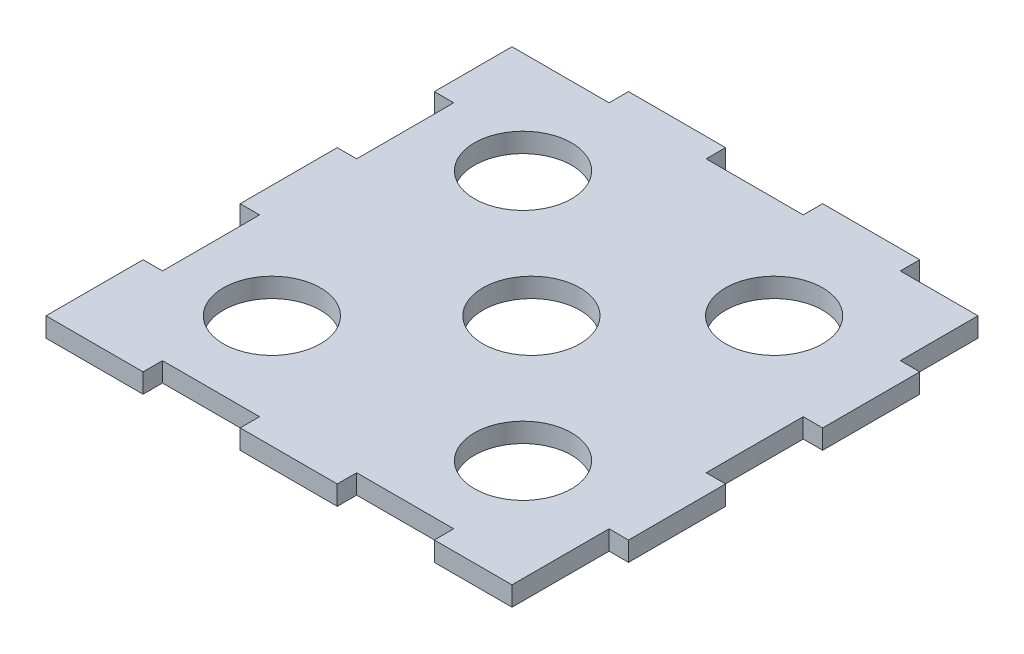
ISO-10303-21;
HEADER;
FILE_DESCRIPTION(('STEP AP214'),'2;1');
FILE_NAME('part.step','',(''),(''),'','','');
FILE_SCHEMA(('AUTOMOTIVE_DESIGN { 1 0 10303 214 1 1 1 1 }'));
ENDSEC;
DATA;
#1=APPLICATION_CONTEXT('core data for automotive mechanical design processes');
#2=APPLICATION_PROTOCOL_DEFINITION('international standard','automotive_design',2000,#1);
#3=PRODUCT_CONTEXT('',#1,'mechanical');
#4=PRODUCT('Part','Part','',(#3));
#5=PRODUCT_RELATED_PRODUCT_CATEGORY('part','',(#4));
#6=PRODUCT_DEFINITION_FORMATION('','',#4);
#7=PRODUCT_DEFINITION_CONTEXT('part definition',#1,'design');
#8=PRODUCT_DEFINITION('design','',#6,#7);
#9=PRODUCT_DEFINITION_SHAPE('','',#8);
#10=(LENGTH_UNIT() NAMED_UNIT(*) SI_UNIT(.MILLI.,.METRE.));
#11=(NAMED_UNIT(*) PLANE_ANGLE_UNIT() SI_UNIT($,.RADIAN.));
#12=(NAMED_UNIT(*) SI_UNIT($,.STERADIAN.) SOLID_ANGLE_UNIT());
#13=UNCERTAINTY_MEASURE_WITH_UNIT(LENGTH_MEASURE(1.E-05),#10,'distance_accuracy_value','');
#14=(GEOMETRIC_REPRESENTATION_CONTEXT(3) GLOBAL_UNCERTAINTY_ASSIGNED_CONTEXT((#13)) GLOBAL_UNIT_ASSIGNED_CONTEXT((#10,
#11,#12)) REPRESENTATION_CONTEXT('',''));
#15=CARTESIAN_POINT('',(0.,0.,0.));
#16=DIRECTION('',(0.,0.,1.));
#17=DIRECTION('',(1.,0.,0.));
#18=AXIS2_PLACEMENT_3D('',#15,#16,#17);
#19=CARTESIAN_POINT('',(0.,4.,0.));
#20=DIRECTION('',(0.,1.,0.));
#21=DIRECTION('',(0.,0.,1.));
#22=AXIS2_PLACEMENT_3D('',#19,#20,#21);
#23=PLANE('',#22);
#24=CARTESIAN_POINT('',(-26.7320869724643,4.,26.7320869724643));
#25=DIRECTION('',(0.,1.,0.));
#26=DIRECTION('',(0.,0.,1.));
#27=AXIS2_PLACEMENT_3D('',#24,#25,#26);
#28=CIRCLE('',#27,10.);
#29=CARTESIAN_POINT('',(-26.7320869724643,4.,36.7320869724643));
#30=VERTEX_POINT('',#29);
#31=EDGE_CURVE('E607',#30,#30,#28,.T.);
#32=ORIENTED_EDGE('',*,*,#31,.F.);
#33=EDGE_LOOP('',(#32));
#34=FACE_BOUND('',#33,.T.);
#35=CARTESIAN_POINT('',(25.,4.,-25.));
#36=DIRECTION('',(0.,1.,0.));
#37=DIRECTION('',(0.,0.,1.));
#38=AXIS2_PLACEMENT_3D('',#35,#36,#37);
#39=CIRCLE('',#38,10.);
#40=CARTESIAN_POINT('',(25.,4.,-15.));
#41=VERTEX_POINT('',#40);
#42=EDGE_CURVE('E619',#41,#41,#39,.T.);
#43=ORIENTED_EDGE('',*,*,#42,.F.);
#44=EDGE_LOOP('',(#43));
#45=FACE_BOUND('',#44,.T.);
#46=DIRECTION('',(0.,0.,-1.));
#47=VECTOR('',#46,1.);
#48=CARTESIAN_POINT('',(46.,4.,30.));
#49=LINE('',#48,#47);
#50=CARTESIAN_POINT('',(46.,4.,50.));
#51=VERTEX_POINT('',#50);
#52=CARTESIAN_POINT('',(46.,4.,30.));
#53=VERTEX_POINT('',#52);
#54=EDGE_CURVE('E369',#51,#53,#49,.T.);
#55=ORIENTED_EDGE('',*,*,#54,.T.);
#56=DIRECTION('',(1.,0.,0.));
#57=VECTOR('',#56,1.);
#58=CARTESIAN_POINT('',(50.,4.,30.));
#59=LINE('',#58,#57);
#60=CARTESIAN_POINT('',(50.,4.,30.));
#61=VERTEX_POINT('',#60);
#62=EDGE_CURVE('E177',#53,#61,#59,.T.);
#63=ORIENTED_EDGE('',*,*,#62,.T.);
#64=DIRECTION('',(0.,0.,-1.));
#65=VECTOR('',#64,1.);
#66=CARTESIAN_POINT('',(50.,4.,9.99999999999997));
#67=LINE('',#66,#65);
#68=CARTESIAN_POINT('',(50.,4.,9.99999999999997));
#69=VERTEX_POINT('',#68);
#70=EDGE_CURVE('E468',#61,#69,#67,.T.);
#71=ORIENTED_EDGE('',*,*,#70,.T.);
#72=DIRECTION('',(-1.,0.,0.));
#73=VECTOR('',#72,1.);
#74=CARTESIAN_POINT('',(46.,4.,9.99999999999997));
#75=LINE('',#74,#73);
#76=CARTESIAN_POINT('',(46.,4.,9.99999999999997));
#77=VERTEX_POINT('',#76);
#78=EDGE_CURVE('E487',#69,#77,#75,.T.);
#79=ORIENTED_EDGE('',*,*,#78,.T.);
#80=DIRECTION('',(0.,0.,-1.));
#81=VECTOR('',#80,1.);
#82=CARTESIAN_POINT('',(46.,4.,-10.));
#83=LINE('',#82,#81);
#84=CARTESIAN_POINT('',(46.,4.,-10.));
#85=VERTEX_POINT('',#84);
#86=EDGE_CURVE('E484',#77,#85,#83,.T.);
#87=ORIENTED_EDGE('',*,*,#86,.T.);
#88=DIRECTION('',(1.,0.,0.));
#89=VECTOR('',#88,1.);
#90=CARTESIAN_POINT('',(50.,4.,-10.));
#91=LINE('',#90,#89);
#92=CARTESIAN_POINT('',(50.,4.,-10.));
#93=VERTEX_POINT('',#92);
#94=EDGE_CURVE('E486',#85,#93,#91,.T.);
#95=ORIENTED_EDGE('',*,*,#94,.T.);
#96=DIRECTION('',(0.,0.,-1.));
#97=VECTOR('',#96,1.);
#98=CARTESIAN_POINT('',(50.,4.,-30.));
#99=LINE('',#98,#97);
#100=CARTESIAN_POINT('',(50.,4.,-30.));
#101=VERTEX_POINT('',#100);
#102=EDGE_CURVE('E489',#93,#101,#99,.T.);
#103=ORIENTED_EDGE('',*,*,#102,.T.);
#104=DIRECTION('',(-1.,0.,0.));
#105=VECTOR('',#104,1.);
#106=CARTESIAN_POINT('',(46.,4.,-30.));
#107=LINE('',#106,#105);
#108=CARTESIAN_POINT('',(46.,4.,-30.));
#109=VERTEX_POINT('',#108);
#110=EDGE_CURVE('E495',#101,#109,#107,.T.);
#111=ORIENTED_EDGE('',*,*,#110,.T.);
#112=DIRECTION('',(0.,0.,-1.));
#113=VECTOR('',#112,1.);
#114=CARTESIAN_POINT('',(46.,4.,-46.));
#115=LINE('',#114,#113);
#116=CARTESIAN_POINT('',(46.,4.,-46.));
#117=VERTEX_POINT('',#116);
#118=EDGE_CURVE('E497',#109,#117,#115,.T.);
#119=ORIENTED_EDGE('',*,*,#118,.T.);
#120=DIRECTION('',(-1.,0.,0.));
#121=VECTOR('',#120,1.);
#122=CARTESIAN_POINT('',(30.,4.,-46.));
#123=LINE('',#122,#121);
#124=CARTESIAN_POINT('',(30.,4.,-46.));
#125=VERTEX_POINT('',#124);
#126=EDGE_CURVE('E499',#117,#125,#123,.T.);
#127=ORIENTED_EDGE('',*,*,#126,.T.);
#128=DIRECTION('',(0.,0.,-1.));
#129=VECTOR('',#128,1.);
#130=CARTESIAN_POINT('',(30.,4.,-50.));
#131=LINE('',#130,#129);
#132=CARTESIAN_POINT('',(30.,4.,-50.));
#133=VERTEX_POINT('',#132);
#134=EDGE_CURVE('E501',#125,#133,#131,.T.);
#135=ORIENTED_EDGE('',*,*,#134,.T.);
#136=DIRECTION('',(-1.,0.,0.));
#137=VECTOR('',#136,1.);
#138=CARTESIAN_POINT('',(9.99999999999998,4.,-50.));
#139=LINE('',#138,#137);
#140=CARTESIAN_POINT('',(9.99999999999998,4.,-50.));
#141=VERTEX_POINT('',#140);
#142=EDGE_CURVE('E503',#133,#141,#139,.T.);
#143=ORIENTED_EDGE('',*,*,#142,.T.);
#144=DIRECTION('',(0.,0.,1.));
#145=VECTOR('',#144,1.);
#146=CARTESIAN_POINT('',(9.99999999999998,4.,-46.));
#147=LINE('',#146,#145);
#148=CARTESIAN_POINT('',(9.99999999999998,4.,-46.));
#149=VERTEX_POINT('',#148);
#150=EDGE_CURVE('E505',#141,#149,#147,.T.);
#151=ORIENTED_EDGE('',*,*,#150,.T.);
#152=DIRECTION('',(-1.,0.,0.));
#153=VECTOR('',#152,1.);
#154=CARTESIAN_POINT('',(-10.,4.,-46.));
#155=LINE('',#154,#153);
#156=CARTESIAN_POINT('',(-10.,4.,-46.));
#157=VERTEX_POINT('',#156);
#158=EDGE_CURVE('E507',#149,#157,#155,.T.);
#159=ORIENTED_EDGE('',*,*,#158,.T.);
#160=DIRECTION('',(0.,0.,-1.));
#161=VECTOR('',#160,1.);
#162=CARTESIAN_POINT('',(-10.,4.,-50.));
#163=LINE('',#162,#161);
#164=CARTESIAN_POINT('',(-10.,4.,-50.));
#165=VERTEX_POINT('',#164);
#166=EDGE_CURVE('E509',#157,#165,#163,.T.);
#167=ORIENTED_EDGE('',*,*,#166,.T.);
#168=DIRECTION('',(-1.,0.,0.));
#169=VECTOR('',#168,1.);
#170=CARTESIAN_POINT('',(-30.,4.,-50.));
#171=LINE('',#170,#169);
#172=CARTESIAN_POINT('',(-30.,4.,-50.));
#173=VERTEX_POINT('',#172);
#174=EDGE_CURVE('E511',#165,#173,#171,.T.);
#175=ORIENTED_EDGE('',*,*,#174,.T.);
#176=DIRECTION('',(0.,0.,1.));
#177=VECTOR('',#176,1.);
#178=CARTESIAN_POINT('',(-30.,4.,-46.));
#179=LINE('',#178,#177);
#180=CARTESIAN_POINT('',(-30.,4.,-46.));
#181=VERTEX_POINT('',#180);
#182=EDGE_CURVE('E513',#173,#181,#179,.T.);
#183=ORIENTED_EDGE('',*,*,#182,.T.);
#184=DIRECTION('',(-1.,0.,0.));
#185=VECTOR('',#184,1.);
#186=CARTESIAN_POINT('',(-50.,4.,-46.));
#187=LINE('',#186,#185);
#188=CARTESIAN_POINT('',(-50.,4.,-46.));
#189=VERTEX_POINT('',#188);
#190=EDGE_CURVE('E515',#181,#189,#187,.T.);
#191=ORIENTED_EDGE('',*,*,#190,.T.);
#192=DIRECTION('',(0.,0.,1.));
#193=VECTOR('',#192,1.);
#194=CARTESIAN_POINT('',(-50.,4.,-46.));
#195=LINE('',#194,#193);
#196=CARTESIAN_POINT('',(-50.,4.,-30.));
#197=VERTEX_POINT('',#196);
#198=EDGE_CURVE('E517',#189,#197,#195,.T.);
#199=ORIENTED_EDGE('',*,*,#198,.T.);
#200=DIRECTION('',(1.,0.,0.));
#201=VECTOR('',#200,1.);
#202=CARTESIAN_POINT('',(-50.,4.,-30.));
#203=LINE('',#202,#201);
#204=CARTESIAN_POINT('',(-46.,4.,-30.));
#205=VERTEX_POINT('',#204);
#206=EDGE_CURVE('E519',#197,#205,#203,.T.);
#207=ORIENTED_EDGE('',*,*,#206,.T.);
#208=DIRECTION('',(0.,0.,1.));
#209=VECTOR('',#208,1.);
#210=CARTESIAN_POINT('',(-46.,4.,-30.));
#211=LINE('',#210,#209);
#212=CARTESIAN_POINT('',(-46.,4.,-10.));
#213=VERTEX_POINT('',#212);
#214=EDGE_CURVE('E521',#205,#213,#211,.T.);
#215=ORIENTED_EDGE('',*,*,#214,.T.);
#216=DIRECTION('',(-1.,0.,0.));
#217=VECTOR('',#216,1.);
#218=CARTESIAN_POINT('',(-46.,4.,-10.));
#219=LINE('',#218,#217);
#220=CARTESIAN_POINT('',(-50.,4.,-10.));
#221=VERTEX_POINT('',#220);
#222=EDGE_CURVE('E523',#213,#221,#219,.T.);
#223=ORIENTED_EDGE('',*,*,#222,.T.);
#224=DIRECTION('',(0.,0.,1.));
#225=VECTOR('',#224,1.);
#226=CARTESIAN_POINT('',(-50.,4.,-10.));
#227=LINE('',#226,#225);
#228=CARTESIAN_POINT('',(-50.,4.,9.99999999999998));
#229=VERTEX_POINT('',#228);
#230=EDGE_CURVE('E525',#221,#229,#227,.T.);
#231=ORIENTED_EDGE('',*,*,#230,.T.);
#232=DIRECTION('',(1.,0.,0.));
#233=VECTOR('',#232,1.);
#234=CARTESIAN_POINT('',(-50.,4.,9.99999999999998));
#235=LINE('',#234,#233);
#236=CARTESIAN_POINT('',(-46.,4.,9.99999999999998));
#237=VERTEX_POINT('',#236);
#238=EDGE_CURVE('E527',#229,#237,#235,.T.);
#239=ORIENTED_EDGE('',*,*,#238,.T.);
#240=DIRECTION('',(0.,0.,1.));
#241=VECTOR('',#240,1.);
#242=CARTESIAN_POINT('',(-46.,4.,9.99999999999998));
#243=LINE('',#242,#241);
#244=CARTESIAN_POINT('',(-46.,4.,30.));
#245=VERTEX_POINT('',#244);
#246=EDGE_CURVE('E529',#237,#245,#243,.T.);
#247=ORIENTED_EDGE('',*,*,#246,.T.);
#248=DIRECTION('',(-1.,0.,0.));
#249=VECTOR('',#248,1.);
#250=CARTESIAN_POINT('',(-46.,4.,30.));
#251=LINE('',#250,#249);
#252=CARTESIAN_POINT('',(-50.,4.,30.));
#253=VERTEX_POINT('',#252);
#254=EDGE_CURVE('E531',#245,#253,#251,.T.);
#255=ORIENTED_EDGE('',*,*,#254,.T.);
#256=DIRECTION('',(0.,0.,1.));
#257=VECTOR('',#256,1.);
#258=CARTESIAN_POINT('',(-50.,4.,30.));
#259=LINE('',#258,#257);
#260=CARTESIAN_POINT('',(-50.,4.,50.));
#261=VERTEX_POINT('',#260);
#262=EDGE_CURVE('E533',#253,#261,#259,.T.);
#263=ORIENTED_EDGE('',*,*,#262,.T.);
#264=DIRECTION('',(1.,0.,0.));
#265=VECTOR('',#264,1.);
#266=CARTESIAN_POINT('',(-50.,4.,50.));
#267=LINE('',#266,#265);
#268=CARTESIAN_POINT('',(-30.,4.,50.));
#269=VERTEX_POINT('',#268);
#270=EDGE_CURVE('E535',#261,#269,#267,.T.);
#271=ORIENTED_EDGE('',*,*,#270,.T.);
#272=DIRECTION('',(0.,0.,-1.));
#273=VECTOR('',#272,1.);
#274=CARTESIAN_POINT('',(-30.,4.,50.));
#275=LINE('',#274,#273);
#276=CARTESIAN_POINT('',(-30.,4.,46.));
#277=VERTEX_POINT('',#276);
#278=EDGE_CURVE('E537',#269,#277,#275,.T.);
#279=ORIENTED_EDGE('',*,*,#278,.T.);
#280=DIRECTION('',(1.,0.,0.));
#281=VECTOR('',#280,1.);
#282=CARTESIAN_POINT('',(-30.,4.,46.));
#283=LINE('',#282,#281);
#284=CARTESIAN_POINT('',(-10.,4.,46.));
#285=VERTEX_POINT('',#284);
#286=EDGE_CURVE('E539',#277,#285,#283,.T.);
#287=ORIENTED_EDGE('',*,*,#286,.T.);
#288=DIRECTION('',(0.,0.,1.));
#289=VECTOR('',#288,1.);
#290=CARTESIAN_POINT('',(-10.,4.,46.));
#291=LINE('',#290,#289);
#292=CARTESIAN_POINT('',(-10.,4.,50.));
#293=VERTEX_POINT('',#292);
#294=EDGE_CURVE('E541',#285,#293,#291,.T.);
#295=ORIENTED_EDGE('',*,*,#294,.T.);
#296=DIRECTION('',(1.,0.,0.));
#297=VECTOR('',#296,1.);
#298=CARTESIAN_POINT('',(-10.,4.,50.));
#299=LINE('',#298,#297);
#300=CARTESIAN_POINT('',(9.99999999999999,4.,50.));
#301=VERTEX_POINT('',#300);
#302=EDGE_CURVE('E543',#293,#301,#299,.T.);
#303=ORIENTED_EDGE('',*,*,#302,.T.);
#304=DIRECTION('',(0.,0.,-1.));
#305=VECTOR('',#304,1.);
#306=CARTESIAN_POINT('',(9.99999999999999,4.,50.));
#307=LINE('',#306,#305);
#308=CARTESIAN_POINT('',(9.99999999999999,4.,46.));
#309=VERTEX_POINT('',#308);
#310=EDGE_CURVE('E280',#301,#309,#307,.T.);
#311=ORIENTED_EDGE('',*,*,#310,.T.);
#312=DIRECTION('',(1.,0.,0.));
#313=VECTOR('',#312,1.);
#314=CARTESIAN_POINT('',(9.99999999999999,4.,46.));
#315=LINE('',#314,#313);
#316=CARTESIAN_POINT('',(30.,4.,46.));
#317=VERTEX_POINT('',#316);
#318=EDGE_CURVE('E274',#309,#317,#315,.T.);
#319=ORIENTED_EDGE('',*,*,#318,.T.);
#320=DIRECTION('',(0.,0.,1.));
#321=VECTOR('',#320,1.);
#322=CARTESIAN_POINT('',(30.,4.,46.));
#323=LINE('',#322,#321);
#324=CARTESIAN_POINT('',(30.,4.,50.));
#325=VERTEX_POINT('',#324);
#326=EDGE_CURVE('E278',#317,#325,#323,.T.);
#327=ORIENTED_EDGE('',*,*,#326,.T.);
#328=DIRECTION('',(1.,0.,0.));
#329=VECTOR('',#328,1.);
#330=CARTESIAN_POINT('',(30.,4.,50.));
#331=LINE('',#330,#329);
#332=EDGE_CURVE('E50',#325,#51,#331,.T.);
#333=ORIENTED_EDGE('',*,*,#332,.T.);
#334=EDGE_LOOP('',(#55,#63,#71,#79,#87,#95,#103,#111,#119,#127,#135,#143,#151,#159,#167,#175,
#183,#191,#199,#207,#215,#223,#231,#239,#247,#255,#263,#271,#279,#287,#295,#303,#311,#319,#327,#333));
#335=FACE_BOUND('',#334,.T.);
#336=CARTESIAN_POINT('',(0.,4.,0.));
#337=DIRECTION('',(0.,1.,0.));
#338=DIRECTION('',(0.,0.,1.));
#339=AXIS2_PLACEMENT_3D('',#336,#337,#338);
#340=CIRCLE('',#339,10.);
#341=CARTESIAN_POINT('',(0.,4.,10.));
#342=VERTEX_POINT('',#341);
#343=EDGE_CURVE('E302',#342,#342,#340,.T.);
#344=ORIENTED_EDGE('',*,*,#343,.F.);
#345=EDGE_LOOP('',(#344));
#346=FACE_BOUND('',#345,.T.);
#347=CARTESIAN_POINT('',(25.,4.,26.7320869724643));
#348=DIRECTION('',(0.,1.,0.));
#349=DIRECTION('',(0.,0.,1.));
#350=AXIS2_PLACEMENT_3D('',#347,#348,#349);
#351=CIRCLE('',#350,10.);
#352=CARTESIAN_POINT('',(25.,4.,36.7320869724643));
#353=VERTEX_POINT('',#352);
#354=EDGE_CURVE('E613',#353,#353,#351,.T.);
#355=ORIENTED_EDGE('',*,*,#354,.F.);
#356=EDGE_LOOP('',(#355));
#357=FACE_BOUND('',#356,.T.);
#358=CARTESIAN_POINT('',(-26.7320869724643,4.,-25.));
#359=DIRECTION('',(0.,1.,0.));
#360=DIRECTION('',(0.,0.,1.));
#361=AXIS2_PLACEMENT_3D('',#358,#359,#360);
#362=CIRCLE('',#361,10.);
#363=CARTESIAN_POINT('',(-26.7320869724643,4.,-15.));
#364=VERTEX_POINT('',#363);
#365=EDGE_CURVE('E598',#364,#364,#362,.T.);
#366=ORIENTED_EDGE('',*,*,#365,.F.);
#367=EDGE_LOOP('',(#366));
#368=FACE_BOUND('',#367,.T.);
#369=ADVANCED_FACE('F33',(#34,#45,#335,#346,#357,#368),#23,.T.);
#370=CARTESIAN_POINT('',(0.,0.,0.));
#371=DIRECTION('',(0.,1.,0.));
#372=DIRECTION('',(0.,0.,1.));
#373=AXIS2_PLACEMENT_3D('',#370,#371,#372);
#374=PLANE('',#373);
#375=DIRECTION('',(0.,0.,-1.));
#376=VECTOR('',#375,1.);
#377=CARTESIAN_POINT('',(46.,0.,30.));
#378=LINE('',#377,#376);
#379=CARTESIAN_POINT('',(46.,0.,50.));
#380=VERTEX_POINT('',#379);
#381=CARTESIAN_POINT('',(46.,0.,30.));
#382=VERTEX_POINT('',#381);
#383=EDGE_CURVE('E298',#380,#382,#378,.T.);
#384=ORIENTED_EDGE('',*,*,#383,.F.);
#385=DIRECTION('',(1.,0.,0.));
#386=VECTOR('',#385,1.);
#387=CARTESIAN_POINT('',(30.,0.,50.));
#388=LINE('',#387,#386);
#389=CARTESIAN_POINT('',(30.,0.,50.));
#390=VERTEX_POINT('',#389);
#391=EDGE_CURVE('E169',#390,#380,#388,.T.);
#392=ORIENTED_EDGE('',*,*,#391,.F.);
#393=DIRECTION('',(0.,0.,1.));
#394=VECTOR('',#393,1.);
#395=CARTESIAN_POINT('',(30.,0.,46.));
#396=LINE('',#395,#394);
#397=CARTESIAN_POINT('',(30.,0.,46.));
#398=VERTEX_POINT('',#397);
#399=EDGE_CURVE('E163',#398,#390,#396,.T.);
#400=ORIENTED_EDGE('',*,*,#399,.F.);
#401=DIRECTION('',(1.,0.,0.));
#402=VECTOR('',#401,1.);
#403=CARTESIAN_POINT('',(9.99999999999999,0.,46.));
#404=LINE('',#403,#402);
#405=CARTESIAN_POINT('',(9.99999999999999,0.,46.));
#406=VERTEX_POINT('',#405);
#407=EDGE_CURVE('E288',#406,#398,#404,.T.);
#408=ORIENTED_EDGE('',*,*,#407,.F.);
#409=DIRECTION('',(0.,0.,-1.));
#410=VECTOR('',#409,1.);
#411=CARTESIAN_POINT('',(9.99999999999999,0.,50.));
#412=LINE('',#411,#410);
#413=CARTESIAN_POINT('',(9.99999999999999,0.,50.));
#414=VERTEX_POINT('',#413);
#415=EDGE_CURVE('E364',#414,#406,#412,.T.);
#416=ORIENTED_EDGE('',*,*,#415,.F.);
#417=DIRECTION('',(1.,0.,0.));
#418=VECTOR('',#417,1.);
#419=CARTESIAN_POINT('',(-10.,0.,50.));
#420=LINE('',#419,#418);
#421=CARTESIAN_POINT('',(-10.,0.,50.));
#422=VERTEX_POINT('',#421);
#423=EDGE_CURVE('E362',#422,#414,#420,.T.);
#424=ORIENTED_EDGE('',*,*,#423,.F.);
#425=DIRECTION('',(0.,0.,1.));
#426=VECTOR('',#425,1.);
#427=CARTESIAN_POINT('',(-10.,0.,46.));
#428=LINE('',#427,#426);
#429=CARTESIAN_POINT('',(-10.,0.,46.));
#430=VERTEX_POINT('',#429);
#431=EDGE_CURVE('E360',#430,#422,#428,.T.);
#432=ORIENTED_EDGE('',*,*,#431,.F.);
#433=DIRECTION('',(1.,0.,0.));
#434=VECTOR('',#433,1.);
#435=CARTESIAN_POINT('',(-30.,0.,46.));
#436=LINE('',#435,#434);
#437=CARTESIAN_POINT('',(-30.,0.,46.));
#438=VERTEX_POINT('',#437);
#439=EDGE_CURVE('E358',#438,#430,#436,.T.);
#440=ORIENTED_EDGE('',*,*,#439,.F.);
#441=DIRECTION('',(0.,0.,-1.));
#442=VECTOR('',#441,1.);
#443=CARTESIAN_POINT('',(-30.,0.,50.));
#444=LINE('',#443,#442);
#445=CARTESIAN_POINT('',(-30.,0.,50.));
#446=VERTEX_POINT('',#445);
#447=EDGE_CURVE('E356',#446,#438,#444,.T.);
#448=ORIENTED_EDGE('',*,*,#447,.F.);
#449=DIRECTION('',(1.,0.,0.));
#450=VECTOR('',#449,1.);
#451=CARTESIAN_POINT('',(-50.,0.,50.));
#452=LINE('',#451,#450);
#453=CARTESIAN_POINT('',(-50.,0.,50.));
#454=VERTEX_POINT('',#453);
#455=EDGE_CURVE('E354',#454,#446,#452,.T.);
#456=ORIENTED_EDGE('',*,*,#455,.F.);
#457=DIRECTION('',(0.,0.,1.));
#458=VECTOR('',#457,1.);
#459=CARTESIAN_POINT('',(-50.,0.,30.));
#460=LINE('',#459,#458);
#461=CARTESIAN_POINT('',(-50.,0.,30.));
#462=VERTEX_POINT('',#461);
#463=EDGE_CURVE('E352',#462,#454,#460,.T.);
#464=ORIENTED_EDGE('',*,*,#463,.F.);
#465=DIRECTION('',(-1.,0.,0.));
#466=VECTOR('',#465,1.);
#467=CARTESIAN_POINT('',(-46.,0.,30.));
#468=LINE('',#467,#466);
#469=CARTESIAN_POINT('',(-46.,0.,30.));
#470=VERTEX_POINT('',#469);
#471=EDGE_CURVE('E350',#470,#462,#468,.T.);
#472=ORIENTED_EDGE('',*,*,#471,.F.);
#473=DIRECTION('',(0.,0.,1.));
#474=VECTOR('',#473,1.);
#475=CARTESIAN_POINT('',(-46.,0.,9.99999999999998));
#476=LINE('',#475,#474);
#477=CARTESIAN_POINT('',(-46.,0.,9.99999999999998));
#478=VERTEX_POINT('',#477);
#479=EDGE_CURVE('E348',#478,#470,#476,.T.);
#480=ORIENTED_EDGE('',*,*,#479,.F.);
#481=DIRECTION('',(1.,0.,0.));
#482=VECTOR('',#481,1.);
#483=CARTESIAN_POINT('',(-50.,0.,9.99999999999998));
#484=LINE('',#483,#482);
#485=CARTESIAN_POINT('',(-50.,0.,9.99999999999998));
#486=VERTEX_POINT('',#485);
#487=EDGE_CURVE('E346',#486,#478,#484,.T.);
#488=ORIENTED_EDGE('',*,*,#487,.F.);
#489=DIRECTION('',(0.,0.,1.));
#490=VECTOR('',#489,1.);
#491=CARTESIAN_POINT('',(-50.,0.,-10.));
#492=LINE('',#491,#490);
#493=CARTESIAN_POINT('',(-50.,0.,-10.));
#494=VERTEX_POINT('',#493);
#495=EDGE_CURVE('E344',#494,#486,#492,.T.);
#496=ORIENTED_EDGE('',*,*,#495,.F.);
#497=DIRECTION('',(-1.,0.,0.));
#498=VECTOR('',#497,1.);
#499=CARTESIAN_POINT('',(-46.,0.,-10.));
#500=LINE('',#499,#498);
#501=CARTESIAN_POINT('',(-46.,0.,-10.));
#502=VERTEX_POINT('',#501);
#503=EDGE_CURVE('E342',#502,#494,#500,.T.);
#504=ORIENTED_EDGE('',*,*,#503,.F.);
#505=DIRECTION('',(0.,0.,1.));
#506=VECTOR('',#505,1.);
#507=CARTESIAN_POINT('',(-46.,0.,-30.));
#508=LINE('',#507,#506);
#509=CARTESIAN_POINT('',(-46.,0.,-30.));
#510=VERTEX_POINT('',#509);
#511=EDGE_CURVE('E340',#510,#502,#508,.T.);
#512=ORIENTED_EDGE('',*,*,#511,.F.);
#513=DIRECTION('',(1.,0.,0.));
#514=VECTOR('',#513,1.);
#515=CARTESIAN_POINT('',(-50.,0.,-30.));
#516=LINE('',#515,#514);
#517=CARTESIAN_POINT('',(-50.,0.,-30.));
#518=VERTEX_POINT('',#517);
#519=EDGE_CURVE('E338',#518,#510,#516,.T.);
#520=ORIENTED_EDGE('',*,*,#519,.F.);
#521=DIRECTION('',(0.,0.,1.));
#522=VECTOR('',#521,1.);
#523=CARTESIAN_POINT('',(-50.,0.,-46.));
#524=LINE('',#523,#522);
#525=CARTESIAN_POINT('',(-50.,0.,-46.));
#526=VERTEX_POINT('',#525);
#527=EDGE_CURVE('E336',#526,#518,#524,.T.);
#528=ORIENTED_EDGE('',*,*,#527,.F.);
#529=DIRECTION('',(-1.,0.,0.));
#530=VECTOR('',#529,1.);
#531=CARTESIAN_POINT('',(-50.,0.,-46.));
#532=LINE('',#531,#530);
#533=CARTESIAN_POINT('',(-30.,0.,-46.));
#534=VERTEX_POINT('',#533);
#535=EDGE_CURVE('E334',#534,#526,#532,.T.);
#536=ORIENTED_EDGE('',*,*,#535,.F.);
#537=DIRECTION('',(0.,0.,1.));
#538=VECTOR('',#537,1.);
#539=CARTESIAN_POINT('',(-30.,0.,-46.));
#540=LINE('',#539,#538);
#541=CARTESIAN_POINT('',(-30.,0.,-50.));
#542=VERTEX_POINT('',#541);
#543=EDGE_CURVE('E332',#542,#534,#540,.T.);
#544=ORIENTED_EDGE('',*,*,#543,.F.);
#545=DIRECTION('',(-1.,0.,0.));
#546=VECTOR('',#545,1.);
#547=CARTESIAN_POINT('',(-30.,0.,-50.));
#548=LINE('',#547,#546);
#549=CARTESIAN_POINT('',(-10.,0.,-50.));
#550=VERTEX_POINT('',#549);
#551=EDGE_CURVE('E330',#550,#542,#548,.T.);
#552=ORIENTED_EDGE('',*,*,#551,.F.);
#553=DIRECTION('',(0.,0.,-1.));
#554=VECTOR('',#553,1.);
#555=CARTESIAN_POINT('',(-10.,0.,-50.));
#556=LINE('',#555,#554);
#557=CARTESIAN_POINT('',(-10.,0.,-46.));
#558=VERTEX_POINT('',#557);
#559=EDGE_CURVE('E328',#558,#550,#556,.T.);
#560=ORIENTED_EDGE('',*,*,#559,.F.);
#561=DIRECTION('',(-1.,0.,0.));
#562=VECTOR('',#561,1.);
#563=CARTESIAN_POINT('',(-10.,0.,-46.));
#564=LINE('',#563,#562);
#565=CARTESIAN_POINT('',(9.99999999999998,0.,-46.));
#566=VERTEX_POINT('',#565);
#567=EDGE_CURVE('E326',#566,#558,#564,.T.);
#568=ORIENTED_EDGE('',*,*,#567,.F.);
#569=DIRECTION('',(0.,0.,1.));
#570=VECTOR('',#569,1.);
#571=CARTESIAN_POINT('',(9.99999999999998,0.,-46.));
#572=LINE('',#571,#570);
#573=CARTESIAN_POINT('',(9.99999999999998,0.,-50.));
#574=VERTEX_POINT('',#573);
#575=EDGE_CURVE('E324',#574,#566,#572,.T.);
#576=ORIENTED_EDGE('',*,*,#575,.F.);
#577=DIRECTION('',(-1.,0.,0.));
#578=VECTOR('',#577,1.);
#579=CARTESIAN_POINT('',(9.99999999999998,0.,-50.));
#580=LINE('',#579,#578);
#581=CARTESIAN_POINT('',(30.,0.,-50.));
#582=VERTEX_POINT('',#581);
#583=EDGE_CURVE('E322',#582,#574,#580,.T.);
#584=ORIENTED_EDGE('',*,*,#583,.F.);
#585=DIRECTION('',(0.,0.,-1.));
#586=VECTOR('',#585,1.);
#587=CARTESIAN_POINT('',(30.,0.,-50.));
#588=LINE('',#587,#586);
#589=CARTESIAN_POINT('',(30.,0.,-46.));
#590=VERTEX_POINT('',#589);
#591=EDGE_CURVE('E320',#590,#582,#588,.T.);
#592=ORIENTED_EDGE('',*,*,#591,.F.);
#593=DIRECTION('',(-1.,0.,0.));
#594=VECTOR('',#593,1.);
#595=CARTESIAN_POINT('',(30.,0.,-46.));
#596=LINE('',#595,#594);
#597=CARTESIAN_POINT('',(46.,0.,-46.));
#598=VERTEX_POINT('',#597);
#599=EDGE_CURVE('E318',#598,#590,#596,.T.);
#600=ORIENTED_EDGE('',*,*,#599,.F.);
#601=DIRECTION('',(0.,0.,-1.));
#602=VECTOR('',#601,1.);
#603=CARTESIAN_POINT('',(46.,0.,-46.));
#604=LINE('',#603,#602);
#605=CARTESIAN_POINT('',(46.,0.,-30.));
#606=VERTEX_POINT('',#605);
#607=EDGE_CURVE('E316',#606,#598,#604,.T.);
#608=ORIENTED_EDGE('',*,*,#607,.F.);
#609=DIRECTION('',(-1.,0.,0.));
#610=VECTOR('',#609,1.);
#611=CARTESIAN_POINT('',(46.,0.,-30.));
#612=LINE('',#611,#610);
#613=CARTESIAN_POINT('',(50.,0.,-30.));
#614=VERTEX_POINT('',#613);
#615=EDGE_CURVE('E314',#614,#606,#612,.T.);
#616=ORIENTED_EDGE('',*,*,#615,.F.);
#617=DIRECTION('',(0.,0.,-1.));
#618=VECTOR('',#617,1.);
#619=CARTESIAN_POINT('',(50.,0.,-30.));
#620=LINE('',#619,#618);
#621=CARTESIAN_POINT('',(50.,0.,-10.));
#622=VERTEX_POINT('',#621);
#623=EDGE_CURVE('E312',#622,#614,#620,.T.);
#624=ORIENTED_EDGE('',*,*,#623,.F.);
#625=DIRECTION('',(1.,0.,0.));
#626=VECTOR('',#625,1.);
#627=CARTESIAN_POINT('',(50.,0.,-10.));
#628=LINE('',#627,#626);
#629=CARTESIAN_POINT('',(46.,0.,-10.));
#630=VERTEX_POINT('',#629);
#631=EDGE_CURVE('E310',#630,#622,#628,.T.);
#632=ORIENTED_EDGE('',*,*,#631,.F.);
#633=DIRECTION('',(0.,0.,-1.));
#634=VECTOR('',#633,1.);
#635=CARTESIAN_POINT('',(46.,0.,-10.));
#636=LINE('',#635,#634);
#637=CARTESIAN_POINT('',(46.,0.,9.99999999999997));
#638=VERTEX_POINT('',#637);
#639=EDGE_CURVE('E308',#638,#630,#636,.T.);
#640=ORIENTED_EDGE('',*,*,#639,.F.);
#641=DIRECTION('',(-1.,0.,0.));
#642=VECTOR('',#641,1.);
#643=CARTESIAN_POINT('',(46.,0.,9.99999999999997));
#644=LINE('',#643,#642);
#645=CARTESIAN_POINT('',(50.,0.,9.99999999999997));
#646=VERTEX_POINT('',#645);
#647=EDGE_CURVE('E306',#646,#638,#644,.T.);
#648=ORIENTED_EDGE('',*,*,#647,.F.);
#649=DIRECTION('',(0.,0.,-1.));
#650=VECTOR('',#649,1.);
#651=CARTESIAN_POINT('',(50.,0.,9.99999999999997));
#652=LINE('',#651,#650);
#653=CARTESIAN_POINT('',(50.,0.,30.));
#654=VERTEX_POINT('',#653);
#655=EDGE_CURVE('E304',#654,#646,#652,.T.);
#656=ORIENTED_EDGE('',*,*,#655,.F.);
#657=DIRECTION('',(1.,0.,0.));
#658=VECTOR('',#657,1.);
#659=CARTESIAN_POINT('',(50.,0.,30.));
#660=LINE('',#659,#658);
#661=EDGE_CURVE('E301',#382,#654,#660,.T.);
#662=ORIENTED_EDGE('',*,*,#661,.F.);
#663=EDGE_LOOP('',(#384,#392,#400,#408,#416,#424,#432,#440,#448,#456,#464,#472,#480,#488,#496,
#504,#512,#520,#528,#536,#544,#552,#560,#568,#576,#584,#592,#600,#608,#616,#624,#632,#640,#648,
#656,#662));
#664=FACE_BOUND('',#663,.T.);
#665=CARTESIAN_POINT('',(0.,0.,0.));
#666=DIRECTION('',(0.,1.,0.));
#667=DIRECTION('',(0.,0.,1.));
#668=AXIS2_PLACEMENT_3D('',#665,#666,#667);
#669=CIRCLE('',#668,10.);
#670=CARTESIAN_POINT('',(0.,0.,10.));
#671=VERTEX_POINT('',#670);
#672=EDGE_CURVE('E622',#671,#671,#669,.T.);
#673=ORIENTED_EDGE('',*,*,#672,.T.);
#674=EDGE_LOOP('',(#673));
#675=FACE_BOUND('',#674,.T.);
#676=CARTESIAN_POINT('',(25.,0.,-25.));
#677=DIRECTION('',(0.,1.,0.));
#678=DIRECTION('',(0.,0.,1.));
#679=AXIS2_PLACEMENT_3D('',#676,#677,#678);
#680=CIRCLE('',#679,10.);
#681=CARTESIAN_POINT('',(25.,0.,-15.));
#682=VERTEX_POINT('',#681);
#683=EDGE_CURVE('E616',#682,#682,#680,.T.);
#684=ORIENTED_EDGE('',*,*,#683,.T.);
#685=EDGE_LOOP('',(#684));
#686=FACE_BOUND('',#685,.T.);
#687=CARTESIAN_POINT('',(25.,0.,26.7320869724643));
#688=DIRECTION('',(0.,1.,0.));
#689=DIRECTION('',(0.,0.,1.));
#690=AXIS2_PLACEMENT_3D('',#687,#688,#689);
#691=CIRCLE('',#690,10.);
#692=CARTESIAN_POINT('',(25.,0.,36.7320869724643));
#693=VERTEX_POINT('',#692);
#694=EDGE_CURVE('E610',#693,#693,#691,.T.);
#695=ORIENTED_EDGE('',*,*,#694,.T.);
#696=EDGE_LOOP('',(#695));
#697=FACE_BOUND('',#696,.T.);
#698=CARTESIAN_POINT('',(-26.7320869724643,0.,26.7320869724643));
#699=DIRECTION('',(0.,1.,0.));
#700=DIRECTION('',(0.,0.,1.));
#701=AXIS2_PLACEMENT_3D('',#698,#699,#700);
#702=CIRCLE('',#701,10.);
#703=CARTESIAN_POINT('',(-26.7320869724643,0.,36.7320869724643));
#704=VERTEX_POINT('',#703);
#705=EDGE_CURVE('E604',#704,#704,#702,.T.);
#706=ORIENTED_EDGE('',*,*,#705,.T.);
#707=EDGE_LOOP('',(#706));
#708=FACE_BOUND('',#707,.T.);
#709=CARTESIAN_POINT('',(-26.7320869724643,0.,-25.));
#710=DIRECTION('',(0.,1.,0.));
#711=DIRECTION('',(0.,0.,1.));
#712=AXIS2_PLACEMENT_3D('',#709,#710,#711);
#713=CIRCLE('',#712,10.);
#714=CARTESIAN_POINT('',(-26.7320869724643,0.,-15.));
#715=VERTEX_POINT('',#714);
#716=EDGE_CURVE('E601',#715,#715,#713,.T.);
#717=ORIENTED_EDGE('',*,*,#716,.T.);
#718=EDGE_LOOP('',(#717));
#719=FACE_BOUND('',#718,.T.);
#720=ADVANCED_FACE('F472',(#664,#675,#686,#697,#708,#719),#374,.F.);
#721=CARTESIAN_POINT('',(46.,4.,30.));
#722=DIRECTION('',(-1.,0.,0.));
#723=DIRECTION('',(0.,0.,1.));
#724=AXIS2_PLACEMENT_3D('',#721,#722,#723);
#725=PLANE('',#724);
#726=ORIENTED_EDGE('',*,*,#383,.T.);
#727=DIRECTION('',(0.,-1.,0.));
#728=VECTOR('',#727,1.);
#729=CARTESIAN_POINT('',(46.,4.,30.));
#730=LINE('',#729,#728);
#731=EDGE_CURVE('E11',#53,#382,#730,.T.);
#732=ORIENTED_EDGE('',*,*,#731,.F.);
#733=ORIENTED_EDGE('',*,*,#54,.F.);
#734=DIRECTION('',(0.,-1.,0.));
#735=VECTOR('',#734,1.);
#736=CARTESIAN_POINT('',(46.,4.,50.));
#737=LINE('',#736,#735);
#738=EDGE_CURVE('E294',#51,#380,#737,.T.);
#739=ORIENTED_EDGE('',*,*,#738,.T.);
#740=EDGE_LOOP('',(#726,#732,#733,#739));
#741=FACE_BOUND('',#740,.T.);
#742=ADVANCED_FACE('F35',(#741),#725,.F.);
#743=CARTESIAN_POINT('',(50.,4.,30.));
#744=DIRECTION('',(0.,0.,-1.));
#745=DIRECTION('',(-1.,0.,0.));
#746=AXIS2_PLACEMENT_3D('',#743,#744,#745);
#747=PLANE('',#746);
#748=ORIENTED_EDGE('',*,*,#661,.T.);
#749=DIRECTION('',(0.,-1.,0.));
#750=VECTOR('',#749,1.);
#751=CARTESIAN_POINT('',(50.,4.,30.));
#752=LINE('',#751,#750);
#753=EDGE_CURVE('E42',#61,#654,#752,.T.);
#754=ORIENTED_EDGE('',*,*,#753,.F.);
#755=ORIENTED_EDGE('',*,*,#62,.F.);
#756=ORIENTED_EDGE('',*,*,#731,.T.);
#757=EDGE_LOOP('',(#748,#754,#755,#756));
#758=FACE_BOUND('',#757,.T.);
#759=ADVANCED_FACE('F981',(#758),#747,.F.);
#760=CARTESIAN_POINT('',(50.,4.,9.99999999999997));
#761=DIRECTION('',(-1.,0.,0.));
#762=DIRECTION('',(0.,0.,1.));
#763=AXIS2_PLACEMENT_3D('',#760,#761,#762);
#764=PLANE('',#763);
#765=ORIENTED_EDGE('',*,*,#655,.T.);
#766=DIRECTION('',(0.,-1.,0.));
#767=VECTOR('',#766,1.);
#768=CARTESIAN_POINT('',(50.,4.,9.99999999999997));
#769=LINE('',#768,#767);
#770=EDGE_CURVE('E460',#69,#646,#769,.T.);
#771=ORIENTED_EDGE('',*,*,#770,.F.);
#772=ORIENTED_EDGE('',*,*,#70,.F.);
#773=ORIENTED_EDGE('',*,*,#753,.T.);
#774=EDGE_LOOP('',(#765,#771,#772,#773));
#775=FACE_BOUND('',#774,.T.);
#776=ADVANCED_FACE('F466',(#775),#764,.F.);
#777=CARTESIAN_POINT('',(46.,4.,9.99999999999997));
#778=DIRECTION('',(0.,0.,1.));
#779=DIRECTION('',(1.,0.,0.));
#780=AXIS2_PLACEMENT_3D('',#777,#778,#779);
#781=PLANE('',#780);
#782=ORIENTED_EDGE('',*,*,#647,.T.);
#783=DIRECTION('',(0.,-1.,0.));
#784=VECTOR('',#783,1.);
#785=CARTESIAN_POINT('',(46.,4.,9.99999999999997));
#786=LINE('',#785,#784);
#787=EDGE_CURVE('E457',#77,#638,#786,.T.);
#788=ORIENTED_EDGE('',*,*,#787,.F.);
#789=ORIENTED_EDGE('',*,*,#78,.F.);
#790=ORIENTED_EDGE('',*,*,#770,.T.);
#791=EDGE_LOOP('',(#782,#788,#789,#790));
#792=FACE_BOUND('',#791,.T.);
#793=ADVANCED_FACE('F478',(#792),#781,.F.);
#794=CARTESIAN_POINT('',(46.,4.,-10.));
#795=DIRECTION('',(-1.,0.,0.));
#796=DIRECTION('',(0.,0.,1.));
#797=AXIS2_PLACEMENT_3D('',#794,#795,#796);
#798=PLANE('',#797);
#799=ORIENTED_EDGE('',*,*,#639,.T.);
#800=DIRECTION('',(0.,-1.,0.));
#801=VECTOR('',#800,1.);
#802=CARTESIAN_POINT('',(46.,4.,-10.));
#803=LINE('',#802,#801);
#804=EDGE_CURVE('E454',#85,#630,#803,.T.);
#805=ORIENTED_EDGE('',*,*,#804,.F.);
#806=ORIENTED_EDGE('',*,*,#86,.F.);
#807=ORIENTED_EDGE('',*,*,#787,.T.);
#808=EDGE_LOOP('',(#799,#805,#806,#807));
#809=FACE_BOUND('',#808,.T.);
#810=ADVANCED_FACE('F482',(#809),#798,.F.);
#811=CARTESIAN_POINT('',(50.,4.,-10.));
#812=DIRECTION('',(0.,0.,-1.));
#813=DIRECTION('',(-1.,0.,0.));
#814=AXIS2_PLACEMENT_3D('',#811,#812,#813);
#815=PLANE('',#814);
#816=ORIENTED_EDGE('',*,*,#631,.T.);
#817=DIRECTION('',(0.,-1.,0.));
#818=VECTOR('',#817,1.);
#819=CARTESIAN_POINT('',(50.,4.,-10.));
#820=LINE('',#819,#818);
#821=EDGE_CURVE('E451',#93,#622,#820,.T.);
#822=ORIENTED_EDGE('',*,*,#821,.F.);
#823=ORIENTED_EDGE('',*,*,#94,.F.);
#824=ORIENTED_EDGE('',*,*,#804,.T.);
#825=EDGE_LOOP('',(#816,#822,#823,#824));
#826=FACE_BOUND('',#825,.T.);
#827=ADVANCED_FACE('F946',(#826),#815,.F.);
#828=CARTESIAN_POINT('',(50.,4.,-30.));
#829=DIRECTION('',(-1.,0.,0.));
#830=DIRECTION('',(0.,0.,1.));
#831=AXIS2_PLACEMENT_3D('',#828,#829,#830);
#832=PLANE('',#831);
#833=ORIENTED_EDGE('',*,*,#623,.T.);
#834=DIRECTION('',(0.,-1.,0.));
#835=VECTOR('',#834,1.);
#836=CARTESIAN_POINT('',(50.,4.,-30.));
#837=LINE('',#836,#835);
#838=EDGE_CURVE('E448',#101,#614,#837,.T.);
#839=ORIENTED_EDGE('',*,*,#838,.F.);
#840=ORIENTED_EDGE('',*,*,#102,.F.);
#841=ORIENTED_EDGE('',*,*,#821,.T.);
#842=EDGE_LOOP('',(#833,#839,#840,#841));
#843=FACE_BOUND('',#842,.T.);
#844=ADVANCED_FACE('F936',(#843),#832,.F.);
#845=CARTESIAN_POINT('',(46.,4.,-30.));
#846=DIRECTION('',(0.,0.,1.));
#847=DIRECTION('',(1.,0.,0.));
#848=AXIS2_PLACEMENT_3D('',#845,#846,#847);
#849=PLANE('',#848);
#850=ORIENTED_EDGE('',*,*,#615,.T.);
#851=DIRECTION('',(0.,-1.,0.));
#852=VECTOR('',#851,1.);
#853=CARTESIAN_POINT('',(46.,4.,-30.));
#854=LINE('',#853,#852);
#855=EDGE_CURVE('E445',#109,#606,#854,.T.);
#856=ORIENTED_EDGE('',*,*,#855,.F.);
#857=ORIENTED_EDGE('',*,*,#110,.F.);
#858=ORIENTED_EDGE('',*,*,#838,.T.);
#859=EDGE_LOOP('',(#850,#856,#857,#858));
#860=FACE_BOUND('',#859,.T.);
#861=ADVANCED_FACE('F926',(#860),#849,.F.);
#862=CARTESIAN_POINT('',(46.,4.,-46.));
#863=DIRECTION('',(-1.,0.,0.));
#864=DIRECTION('',(0.,0.,1.));
#865=AXIS2_PLACEMENT_3D('',#862,#863,#864);
#866=PLANE('',#865);
#867=ORIENTED_EDGE('',*,*,#607,.T.);
#868=DIRECTION('',(0.,-1.,0.));
#869=VECTOR('',#868,1.);
#870=CARTESIAN_POINT('',(46.,4.,-46.));
#871=LINE('',#870,#869);
#872=EDGE_CURVE('E442',#117,#598,#871,.T.);
#873=ORIENTED_EDGE('',*,*,#872,.F.);
#874=ORIENTED_EDGE('',*,*,#118,.F.);
#875=ORIENTED_EDGE('',*,*,#855,.T.);
#876=EDGE_LOOP('',(#867,#873,#874,#875));
#877=FACE_BOUND('',#876,.T.);
#878=ADVANCED_FACE('F916',(#877),#866,.F.);
#879=CARTESIAN_POINT('',(30.,4.,-46.));
#880=DIRECTION('',(0.,0.,1.));
#881=DIRECTION('',(1.,0.,0.));
#882=AXIS2_PLACEMENT_3D('',#879,#880,#881);
#883=PLANE('',#882);
#884=ORIENTED_EDGE('',*,*,#599,.T.);
#885=DIRECTION('',(0.,-1.,0.));
#886=VECTOR('',#885,1.);
#887=CARTESIAN_POINT('',(30.,4.,-46.));
#888=LINE('',#887,#886);
#889=EDGE_CURVE('E439',#125,#590,#888,.T.);
#890=ORIENTED_EDGE('',*,*,#889,.F.);
#891=ORIENTED_EDGE('',*,*,#126,.F.);
#892=ORIENTED_EDGE('',*,*,#872,.T.);
#893=EDGE_LOOP('',(#884,#890,#891,#892));
#894=FACE_BOUND('',#893,.T.);
#895=ADVANCED_FACE('F906',(#894),#883,.F.);
#896=CARTESIAN_POINT('',(30.,4.,-50.));
#897=DIRECTION('',(-1.,0.,0.));
#898=DIRECTION('',(0.,0.,1.));
#899=AXIS2_PLACEMENT_3D('',#896,#897,#898);
#900=PLANE('',#899);
#901=ORIENTED_EDGE('',*,*,#591,.T.);
#902=DIRECTION('',(0.,-1.,0.));
#903=VECTOR('',#902,1.);
#904=CARTESIAN_POINT('',(30.,4.,-50.));
#905=LINE('',#904,#903);
#906=EDGE_CURVE('E436',#133,#582,#905,.T.);
#907=ORIENTED_EDGE('',*,*,#906,.F.);
#908=ORIENTED_EDGE('',*,*,#134,.F.);
#909=ORIENTED_EDGE('',*,*,#889,.T.);
#910=EDGE_LOOP('',(#901,#907,#908,#909));
#911=FACE_BOUND('',#910,.T.);
#912=ADVANCED_FACE('F896',(#911),#900,.F.);
#913=CARTESIAN_POINT('',(9.99999999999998,4.,-50.));
#914=DIRECTION('',(0.,0.,1.));
#915=DIRECTION('',(1.,0.,0.));
#916=AXIS2_PLACEMENT_3D('',#913,#914,#915);
#917=PLANE('',#916);
#918=ORIENTED_EDGE('',*,*,#583,.T.);
#919=DIRECTION('',(0.,-1.,0.));
#920=VECTOR('',#919,1.);
#921=CARTESIAN_POINT('',(9.99999999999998,4.,-50.));
#922=LINE('',#921,#920);
#923=EDGE_CURVE('E433',#141,#574,#922,.T.);
#924=ORIENTED_EDGE('',*,*,#923,.F.);
#925=ORIENTED_EDGE('',*,*,#142,.F.);
#926=ORIENTED_EDGE('',*,*,#906,.T.);
#927=EDGE_LOOP('',(#918,#924,#925,#926));
#928=FACE_BOUND('',#927,.T.);
#929=ADVANCED_FACE('F886',(#928),#917,.F.);
#930=CARTESIAN_POINT('',(9.99999999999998,4.,-46.));
#931=DIRECTION('',(1.,0.,0.));
#932=DIRECTION('',(0.,0.,-1.));
#933=AXIS2_PLACEMENT_3D('',#930,#931,#932);
#934=PLANE('',#933);
#935=ORIENTED_EDGE('',*,*,#575,.T.);
#936=DIRECTION('',(0.,-1.,0.));
#937=VECTOR('',#936,1.);
#938=CARTESIAN_POINT('',(9.99999999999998,4.,-46.));
#939=LINE('',#938,#937);
#940=EDGE_CURVE('E430',#149,#566,#939,.T.);
#941=ORIENTED_EDGE('',*,*,#940,.F.);
#942=ORIENTED_EDGE('',*,*,#150,.F.);
#943=ORIENTED_EDGE('',*,*,#923,.T.);
#944=EDGE_LOOP('',(#935,#941,#942,#943));
#945=FACE_BOUND('',#944,.T.);
#946=ADVANCED_FACE('F876',(#945),#934,.F.);
#947=CARTESIAN_POINT('',(-10.,4.,-46.));
#948=DIRECTION('',(0.,0.,1.));
#949=DIRECTION('',(1.,0.,0.));
#950=AXIS2_PLACEMENT_3D('',#947,#948,#949);
#951=PLANE('',#950);
#952=ORIENTED_EDGE('',*,*,#567,.T.);
#953=DIRECTION('',(0.,-1.,0.));
#954=VECTOR('',#953,1.);
#955=CARTESIAN_POINT('',(-10.,4.,-46.));
#956=LINE('',#955,#954);
#957=EDGE_CURVE('E427',#157,#558,#956,.T.);
#958=ORIENTED_EDGE('',*,*,#957,.F.);
#959=ORIENTED_EDGE('',*,*,#158,.F.);
#960=ORIENTED_EDGE('',*,*,#940,.T.);
#961=EDGE_LOOP('',(#952,#958,#959,#960));
#962=FACE_BOUND('',#961,.T.);
#963=ADVANCED_FACE('F866',(#962),#951,.F.);
#964=CARTESIAN_POINT('',(-10.,4.,-50.));
#965=DIRECTION('',(-1.,0.,0.));
#966=DIRECTION('',(0.,0.,1.));
#967=AXIS2_PLACEMENT_3D('',#964,#965,#966);
#968=PLANE('',#967);
#969=ORIENTED_EDGE('',*,*,#559,.T.);
#970=DIRECTION('',(0.,-1.,0.));
#971=VECTOR('',#970,1.);
#972=CARTESIAN_POINT('',(-10.,4.,-50.));
#973=LINE('',#972,#971);
#974=EDGE_CURVE('E424',#165,#550,#973,.T.);
#975=ORIENTED_EDGE('',*,*,#974,.F.);
#976=ORIENTED_EDGE('',*,*,#166,.F.);
#977=ORIENTED_EDGE('',*,*,#957,.T.);
#978=EDGE_LOOP('',(#969,#975,#976,#977));
#979=FACE_BOUND('',#978,.T.);
#980=ADVANCED_FACE('F856',(#979),#968,.F.);
#981=CARTESIAN_POINT('',(-30.,4.,-50.));
#982=DIRECTION('',(0.,0.,1.));
#983=DIRECTION('',(1.,0.,0.));
#984=AXIS2_PLACEMENT_3D('',#981,#982,#983);
#985=PLANE('',#984);
#986=ORIENTED_EDGE('',*,*,#551,.T.);
#987=DIRECTION('',(0.,-1.,0.));
#988=VECTOR('',#987,1.);
#989=CARTESIAN_POINT('',(-30.,4.,-50.));
#990=LINE('',#989,#988);
#991=EDGE_CURVE('E421',#173,#542,#990,.T.);
#992=ORIENTED_EDGE('',*,*,#991,.F.);
#993=ORIENTED_EDGE('',*,*,#174,.F.);
#994=ORIENTED_EDGE('',*,*,#974,.T.);
#995=EDGE_LOOP('',(#986,#992,#993,#994));
#996=FACE_BOUND('',#995,.T.);
#997=ADVANCED_FACE('F846',(#996),#985,.F.);
#998=CARTESIAN_POINT('',(-30.,4.,-46.));
#999=DIRECTION('',(1.,0.,0.));
#1000=DIRECTION('',(0.,0.,-1.));
#1001=AXIS2_PLACEMENT_3D('',#998,#999,#1000);
#1002=PLANE('',#1001);
#1003=ORIENTED_EDGE('',*,*,#543,.T.);
#1004=DIRECTION('',(0.,-1.,0.));
#1005=VECTOR('',#1004,1.);
#1006=CARTESIAN_POINT('',(-30.,4.,-46.));
#1007=LINE('',#1006,#1005);
#1008=EDGE_CURVE('E418',#181,#534,#1007,.T.);
#1009=ORIENTED_EDGE('',*,*,#1008,.F.);
#1010=ORIENTED_EDGE('',*,*,#182,.F.);
#1011=ORIENTED_EDGE('',*,*,#991,.T.);
#1012=EDGE_LOOP('',(#1003,#1009,#1010,#1011));
#1013=FACE_BOUND('',#1012,.T.);
#1014=ADVANCED_FACE('F836',(#1013),#1002,.F.);
#1015=CARTESIAN_POINT('',(-50.,4.,-46.));
#1016=DIRECTION('',(0.,0.,1.));
#1017=DIRECTION('',(1.,0.,0.));
#1018=AXIS2_PLACEMENT_3D('',#1015,#1016,#1017);
#1019=PLANE('',#1018);
#1020=ORIENTED_EDGE('',*,*,#535,.T.);
#1021=DIRECTION('',(0.,-1.,0.));
#1022=VECTOR('',#1021,1.);
#1023=CARTESIAN_POINT('',(-50.,4.,-46.));
#1024=LINE('',#1023,#1022);
#1025=EDGE_CURVE('E415',#189,#526,#1024,.T.);
#1026=ORIENTED_EDGE('',*,*,#1025,.F.);
#1027=ORIENTED_EDGE('',*,*,#190,.F.);
#1028=ORIENTED_EDGE('',*,*,#1008,.T.);
#1029=EDGE_LOOP('',(#1020,#1026,#1027,#1028));
#1030=FACE_BOUND('',#1029,.T.);
#1031=ADVANCED_FACE('F826',(#1030),#1019,.F.);
#1032=CARTESIAN_POINT('',(-50.,4.,-46.));
#1033=DIRECTION('',(1.,0.,0.));
#1034=DIRECTION('',(0.,0.,-1.));
#1035=AXIS2_PLACEMENT_3D('',#1032,#1033,#1034);
#1036=PLANE('',#1035);
#1037=ORIENTED_EDGE('',*,*,#527,.T.);
#1038=DIRECTION('',(0.,-1.,0.));
#1039=VECTOR('',#1038,1.);
#1040=CARTESIAN_POINT('',(-50.,4.,-30.));
#1041=LINE('',#1040,#1039);
#1042=EDGE_CURVE('E412',#197,#518,#1041,.T.);
#1043=ORIENTED_EDGE('',*,*,#1042,.F.);
#1044=ORIENTED_EDGE('',*,*,#198,.F.);
#1045=ORIENTED_EDGE('',*,*,#1025,.T.);
#1046=EDGE_LOOP('',(#1037,#1043,#1044,#1045));
#1047=FACE_BOUND('',#1046,.T.);
#1048=ADVANCED_FACE('F816',(#1047),#1036,.F.);
#1049=CARTESIAN_POINT('',(-50.,4.,-30.));
#1050=DIRECTION('',(0.,0.,-1.));
#1051=DIRECTION('',(-1.,0.,0.));
#1052=AXIS2_PLACEMENT_3D('',#1049,#1050,#1051);
#1053=PLANE('',#1052);
#1054=ORIENTED_EDGE('',*,*,#519,.T.);
#1055=DIRECTION('',(0.,-1.,0.));
#1056=VECTOR('',#1055,1.);
#1057=CARTESIAN_POINT('',(-46.,4.,-30.));
#1058=LINE('',#1057,#1056);
#1059=EDGE_CURVE('E409',#205,#510,#1058,.T.);
#1060=ORIENTED_EDGE('',*,*,#1059,.F.);
#1061=ORIENTED_EDGE('',*,*,#206,.F.);
#1062=ORIENTED_EDGE('',*,*,#1042,.T.);
#1063=EDGE_LOOP('',(#1054,#1060,#1061,#1062));
#1064=FACE_BOUND('',#1063,.T.);
#1065=ADVANCED_FACE('F806',(#1064),#1053,.F.);
#1066=CARTESIAN_POINT('',(-46.,4.,-30.));
#1067=DIRECTION('',(1.,0.,0.));
#1068=DIRECTION('',(0.,0.,-1.));
#1069=AXIS2_PLACEMENT_3D('',#1066,#1067,#1068);
#1070=PLANE('',#1069);
#1071=ORIENTED_EDGE('',*,*,#511,.T.);
#1072=DIRECTION('',(0.,-1.,0.));
#1073=VECTOR('',#1072,1.);
#1074=CARTESIAN_POINT('',(-46.,4.,-10.));
#1075=LINE('',#1074,#1073);
#1076=EDGE_CURVE('E406',#213,#502,#1075,.T.);
#1077=ORIENTED_EDGE('',*,*,#1076,.F.);
#1078=ORIENTED_EDGE('',*,*,#214,.F.);
#1079=ORIENTED_EDGE('',*,*,#1059,.T.);
#1080=EDGE_LOOP('',(#1071,#1077,#1078,#1079));
#1081=FACE_BOUND('',#1080,.T.);
#1082=ADVANCED_FACE('F796',(#1081),#1070,.F.);
#1083=CARTESIAN_POINT('',(-46.,4.,-10.));
#1084=DIRECTION('',(0.,0.,1.));
#1085=DIRECTION('',(1.,0.,0.));
#1086=AXIS2_PLACEMENT_3D('',#1083,#1084,#1085);
#1087=PLANE('',#1086);
#1088=ORIENTED_EDGE('',*,*,#503,.T.);
#1089=DIRECTION('',(0.,-1.,0.));
#1090=VECTOR('',#1089,1.);
#1091=CARTESIAN_POINT('',(-50.,4.,-10.));
#1092=LINE('',#1091,#1090);
#1093=EDGE_CURVE('E403',#221,#494,#1092,.T.);
#1094=ORIENTED_EDGE('',*,*,#1093,.F.);
#1095=ORIENTED_EDGE('',*,*,#222,.F.);
#1096=ORIENTED_EDGE('',*,*,#1076,.T.);
#1097=EDGE_LOOP('',(#1088,#1094,#1095,#1096));
#1098=FACE_BOUND('',#1097,.T.);
#1099=ADVANCED_FACE('F786',(#1098),#1087,.F.);
#1100=CARTESIAN_POINT('',(-50.,4.,-10.));
#1101=DIRECTION('',(1.,0.,0.));
#1102=DIRECTION('',(0.,0.,-1.));
#1103=AXIS2_PLACEMENT_3D('',#1100,#1101,#1102);
#1104=PLANE('',#1103);
#1105=ORIENTED_EDGE('',*,*,#495,.T.);
#1106=DIRECTION('',(0.,-1.,0.));
#1107=VECTOR('',#1106,1.);
#1108=CARTESIAN_POINT('',(-50.,4.,9.99999999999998));
#1109=LINE('',#1108,#1107);
#1110=EDGE_CURVE('E400',#229,#486,#1109,.T.);
#1111=ORIENTED_EDGE('',*,*,#1110,.F.);
#1112=ORIENTED_EDGE('',*,*,#230,.F.);
#1113=ORIENTED_EDGE('',*,*,#1093,.T.);
#1114=EDGE_LOOP('',(#1105,#1111,#1112,#1113));
#1115=FACE_BOUND('',#1114,.T.);
#1116=ADVANCED_FACE('F776',(#1115),#1104,.F.);
#1117=CARTESIAN_POINT('',(-50.,4.,9.99999999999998));
#1118=DIRECTION('',(0.,0.,-1.));
#1119=DIRECTION('',(-1.,0.,0.));
#1120=AXIS2_PLACEMENT_3D('',#1117,#1118,#1119);
#1121=PLANE('',#1120);
#1122=ORIENTED_EDGE('',*,*,#487,.T.);
#1123=DIRECTION('',(0.,-1.,0.));
#1124=VECTOR('',#1123,1.);
#1125=CARTESIAN_POINT('',(-46.,4.,9.99999999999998));
#1126=LINE('',#1125,#1124);
#1127=EDGE_CURVE('E397',#237,#478,#1126,.T.);
#1128=ORIENTED_EDGE('',*,*,#1127,.F.);
#1129=ORIENTED_EDGE('',*,*,#238,.F.);
#1130=ORIENTED_EDGE('',*,*,#1110,.T.);
#1131=EDGE_LOOP('',(#1122,#1128,#1129,#1130));
#1132=FACE_BOUND('',#1131,.T.);
#1133=ADVANCED_FACE('F766',(#1132),#1121,.F.);
#1134=CARTESIAN_POINT('',(-46.,4.,9.99999999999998));
#1135=DIRECTION('',(1.,0.,0.));
#1136=DIRECTION('',(0.,0.,-1.));
#1137=AXIS2_PLACEMENT_3D('',#1134,#1135,#1136);
#1138=PLANE('',#1137);
#1139=ORIENTED_EDGE('',*,*,#479,.T.);
#1140=DIRECTION('',(0.,-1.,0.));
#1141=VECTOR('',#1140,1.);
#1142=CARTESIAN_POINT('',(-46.,4.,30.));
#1143=LINE('',#1142,#1141);
#1144=EDGE_CURVE('E394',#245,#470,#1143,.T.);
#1145=ORIENTED_EDGE('',*,*,#1144,.F.);
#1146=ORIENTED_EDGE('',*,*,#246,.F.);
#1147=ORIENTED_EDGE('',*,*,#1127,.T.);
#1148=EDGE_LOOP('',(#1139,#1145,#1146,#1147));
#1149=FACE_BOUND('',#1148,.T.);
#1150=ADVANCED_FACE('F756',(#1149),#1138,.F.);
#1151=CARTESIAN_POINT('',(-46.,4.,30.));
#1152=DIRECTION('',(0.,0.,1.));
#1153=DIRECTION('',(1.,0.,0.));
#1154=AXIS2_PLACEMENT_3D('',#1151,#1152,#1153);
#1155=PLANE('',#1154);
#1156=ORIENTED_EDGE('',*,*,#471,.T.);
#1157=DIRECTION('',(0.,-1.,0.));
#1158=VECTOR('',#1157,1.);
#1159=CARTESIAN_POINT('',(-50.,4.,30.));
#1160=LINE('',#1159,#1158);
#1161=EDGE_CURVE('E391',#253,#462,#1160,.T.);
#1162=ORIENTED_EDGE('',*,*,#1161,.F.);
#1163=ORIENTED_EDGE('',*,*,#254,.F.);
#1164=ORIENTED_EDGE('',*,*,#1144,.T.);
#1165=EDGE_LOOP('',(#1156,#1162,#1163,#1164));
#1166=FACE_BOUND('',#1165,.T.);
#1167=ADVANCED_FACE('F746',(#1166),#1155,.F.);
#1168=CARTESIAN_POINT('',(-50.,4.,30.));
#1169=DIRECTION('',(1.,0.,0.));
#1170=DIRECTION('',(0.,0.,-1.));
#1171=AXIS2_PLACEMENT_3D('',#1168,#1169,#1170);
#1172=PLANE('',#1171);
#1173=ORIENTED_EDGE('',*,*,#463,.T.);
#1174=DIRECTION('',(0.,-1.,0.));
#1175=VECTOR('',#1174,1.);
#1176=CARTESIAN_POINT('',(-50.,4.,50.));
#1177=LINE('',#1176,#1175);
#1178=EDGE_CURVE('E388',#261,#454,#1177,.T.);
#1179=ORIENTED_EDGE('',*,*,#1178,.F.);
#1180=ORIENTED_EDGE('',*,*,#262,.F.);
#1181=ORIENTED_EDGE('',*,*,#1161,.T.);
#1182=EDGE_LOOP('',(#1173,#1179,#1180,#1181));
#1183=FACE_BOUND('',#1182,.T.);
#1184=ADVANCED_FACE('F736',(#1183),#1172,.F.);
#1185=CARTESIAN_POINT('',(-50.,4.,50.));
#1186=DIRECTION('',(0.,0.,-1.));
#1187=DIRECTION('',(-1.,0.,0.));
#1188=AXIS2_PLACEMENT_3D('',#1185,#1186,#1187);
#1189=PLANE('',#1188);
#1190=ORIENTED_EDGE('',*,*,#455,.T.);
#1191=DIRECTION('',(0.,-1.,0.));
#1192=VECTOR('',#1191,1.);
#1193=CARTESIAN_POINT('',(-30.,4.,50.));
#1194=LINE('',#1193,#1192);
#1195=EDGE_CURVE('E385',#269,#446,#1194,.T.);
#1196=ORIENTED_EDGE('',*,*,#1195,.F.);
#1197=ORIENTED_EDGE('',*,*,#270,.F.);
#1198=ORIENTED_EDGE('',*,*,#1178,.T.);
#1199=EDGE_LOOP('',(#1190,#1196,#1197,#1198));
#1200=FACE_BOUND('',#1199,.T.);
#1201=ADVANCED_FACE('F726',(#1200),#1189,.F.);
#1202=CARTESIAN_POINT('',(-30.,4.,50.));
#1203=DIRECTION('',(-1.,0.,0.));
#1204=DIRECTION('',(0.,0.,1.));
#1205=AXIS2_PLACEMENT_3D('',#1202,#1203,#1204);
#1206=PLANE('',#1205);
#1207=ORIENTED_EDGE('',*,*,#447,.T.);
#1208=DIRECTION('',(0.,-1.,0.));
#1209=VECTOR('',#1208,1.);
#1210=CARTESIAN_POINT('',(-30.,4.,46.));
#1211=LINE('',#1210,#1209);
#1212=EDGE_CURVE('E382',#277,#438,#1211,.T.);
#1213=ORIENTED_EDGE('',*,*,#1212,.F.);
#1214=ORIENTED_EDGE('',*,*,#278,.F.);
#1215=ORIENTED_EDGE('',*,*,#1195,.T.);
#1216=EDGE_LOOP('',(#1207,#1213,#1214,#1215));
#1217=FACE_BOUND('',#1216,.T.);
#1218=ADVANCED_FACE('F716',(#1217),#1206,.F.);
#1219=CARTESIAN_POINT('',(-30.,4.,46.));
#1220=DIRECTION('',(0.,0.,-1.));
#1221=DIRECTION('',(-1.,0.,0.));
#1222=AXIS2_PLACEMENT_3D('',#1219,#1220,#1221);
#1223=PLANE('',#1222);
#1224=ORIENTED_EDGE('',*,*,#439,.T.);
#1225=DIRECTION('',(0.,-1.,0.));
#1226=VECTOR('',#1225,1.);
#1227=CARTESIAN_POINT('',(-10.,4.,46.));
#1228=LINE('',#1227,#1226);
#1229=EDGE_CURVE('E379',#285,#430,#1228,.T.);
#1230=ORIENTED_EDGE('',*,*,#1229,.F.);
#1231=ORIENTED_EDGE('',*,*,#286,.F.);
#1232=ORIENTED_EDGE('',*,*,#1212,.T.);
#1233=EDGE_LOOP('',(#1224,#1230,#1231,#1232));
#1234=FACE_BOUND('',#1233,.T.);
#1235=ADVANCED_FACE('F706',(#1234),#1223,.F.);
#1236=CARTESIAN_POINT('',(-10.,4.,46.));
#1237=DIRECTION('',(1.,0.,0.));
#1238=DIRECTION('',(0.,0.,-1.));
#1239=AXIS2_PLACEMENT_3D('',#1236,#1237,#1238);
#1240=PLANE('',#1239);
#1241=ORIENTED_EDGE('',*,*,#431,.T.);
#1242=DIRECTION('',(0.,-1.,0.));
#1243=VECTOR('',#1242,1.);
#1244=CARTESIAN_POINT('',(-10.,4.,50.));
#1245=LINE('',#1244,#1243);
#1246=EDGE_CURVE('E376',#293,#422,#1245,.T.);
#1247=ORIENTED_EDGE('',*,*,#1246,.F.);
#1248=ORIENTED_EDGE('',*,*,#294,.F.);
#1249=ORIENTED_EDGE('',*,*,#1229,.T.);
#1250=EDGE_LOOP('',(#1241,#1247,#1248,#1249));
#1251=FACE_BOUND('',#1250,.T.);
#1252=ADVANCED_FACE('F697',(#1251),#1240,.F.);
#1253=CARTESIAN_POINT('',(-10.,4.,50.));
#1254=DIRECTION('',(0.,0.,-1.));
#1255=DIRECTION('',(-1.,0.,0.));
#1256=AXIS2_PLACEMENT_3D('',#1253,#1254,#1255);
#1257=PLANE('',#1256);
#1258=ORIENTED_EDGE('',*,*,#423,.T.);
#1259=DIRECTION('',(0.,-1.,0.));
#1260=VECTOR('',#1259,1.);
#1261=CARTESIAN_POINT('',(9.99999999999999,4.,50.));
#1262=LINE('',#1261,#1260);
#1263=EDGE_CURVE('E373',#301,#414,#1262,.T.);
#1264=ORIENTED_EDGE('',*,*,#1263,.F.);
#1265=ORIENTED_EDGE('',*,*,#302,.F.);
#1266=ORIENTED_EDGE('',*,*,#1246,.T.);
#1267=EDGE_LOOP('',(#1258,#1264,#1265,#1266));
#1268=FACE_BOUND('',#1267,.T.);
#1269=ADVANCED_FACE('F549',(#1268),#1257,.F.);
#1270=CARTESIAN_POINT('',(9.99999999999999,4.,50.));
#1271=DIRECTION('',(-1.,0.,0.));
#1272=DIRECTION('',(0.,0.,1.));
#1273=AXIS2_PLACEMENT_3D('',#1270,#1271,#1272);
#1274=PLANE('',#1273);
#1275=ORIENTED_EDGE('',*,*,#415,.T.);
#1276=DIRECTION('',(0.,-1.,0.));
#1277=VECTOR('',#1276,1.);
#1278=CARTESIAN_POINT('',(9.99999999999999,4.,46.));
#1279=LINE('',#1278,#1277);
#1280=EDGE_CURVE('E289',#309,#406,#1279,.T.);
#1281=ORIENTED_EDGE('',*,*,#1280,.F.);
#1282=ORIENTED_EDGE('',*,*,#310,.F.);
#1283=ORIENTED_EDGE('',*,*,#1263,.T.);
#1284=EDGE_LOOP('',(#1275,#1281,#1282,#1283));
#1285=FACE_BOUND('',#1284,.T.);
#1286=ADVANCED_FACE('F553',(#1285),#1274,.F.);
#1287=CARTESIAN_POINT('',(9.99999999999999,4.,46.));
#1288=DIRECTION('',(0.,0.,-1.));
#1289=DIRECTION('',(-1.,0.,0.));
#1290=AXIS2_PLACEMENT_3D('',#1287,#1288,#1289);
#1291=PLANE('',#1290);
#1292=ORIENTED_EDGE('',*,*,#407,.T.);
#1293=DIRECTION('',(0.,-1.,0.));
#1294=VECTOR('',#1293,1.);
#1295=CARTESIAN_POINT('',(30.,4.,46.));
#1296=LINE('',#1295,#1294);
#1297=EDGE_CURVE('E285',#317,#398,#1296,.T.);
#1298=ORIENTED_EDGE('',*,*,#1297,.F.);
#1299=ORIENTED_EDGE('',*,*,#318,.F.);
#1300=ORIENTED_EDGE('',*,*,#1280,.T.);
#1301=EDGE_LOOP('',(#1292,#1298,#1299,#1300));
#1302=FACE_BOUND('',#1301,.T.);
#1303=ADVANCED_FACE('F286',(#1302),#1291,.F.);
#1304=CARTESIAN_POINT('',(30.,4.,46.));
#1305=DIRECTION('',(1.,0.,0.));
#1306=DIRECTION('',(0.,0.,-1.));
#1307=AXIS2_PLACEMENT_3D('',#1304,#1305,#1306);
#1308=PLANE('',#1307);
#1309=ORIENTED_EDGE('',*,*,#399,.T.);
#1310=DIRECTION('',(0.,-1.,0.));
#1311=VECTOR('',#1310,1.);
#1312=CARTESIAN_POINT('',(30.,4.,50.));
#1313=LINE('',#1312,#1311);
#1314=EDGE_CURVE('E290',#325,#390,#1313,.T.);
#1315=ORIENTED_EDGE('',*,*,#1314,.F.);
#1316=ORIENTED_EDGE('',*,*,#326,.F.);
#1317=ORIENTED_EDGE('',*,*,#1297,.T.);
#1318=EDGE_LOOP('',(#1309,#1315,#1316,#1317));
#1319=FACE_BOUND('',#1318,.T.);
#1320=ADVANCED_FACE('F292',(#1319),#1308,.F.);
#1321=CARTESIAN_POINT('',(30.,4.,50.));
#1322=DIRECTION('',(0.,0.,-1.));
#1323=DIRECTION('',(-1.,0.,0.));
#1324=AXIS2_PLACEMENT_3D('',#1321,#1322,#1323);
#1325=PLANE('',#1324);
#1326=ORIENTED_EDGE('',*,*,#391,.T.);
#1327=ORIENTED_EDGE('',*,*,#738,.F.);
#1328=ORIENTED_EDGE('',*,*,#332,.F.);
#1329=ORIENTED_EDGE('',*,*,#1314,.T.);
#1330=EDGE_LOOP('',(#1326,#1327,#1328,#1329));
#1331=FACE_BOUND('',#1330,.T.);
#1332=ADVANCED_FACE('F557',(#1331),#1325,.F.);
#1333=CARTESIAN_POINT('',(0.,4.,0.));
#1334=DIRECTION('',(0.,-1.,0.));
#1335=DIRECTION('',(0.,0.,-1.));
#1336=AXIS2_PLACEMENT_3D('',#1333,#1334,#1335);
#1337=CYLINDRICAL_SURFACE('',#1336,10.);
#1338=ORIENTED_EDGE('',*,*,#343,.T.);
#1339=EDGE_LOOP('',(#1338));
#1340=FACE_BOUND('',#1339,.T.);
#1341=ORIENTED_EDGE('',*,*,#672,.F.);
#1342=EDGE_LOOP('',(#1341));
#1343=FACE_BOUND('',#1342,.T.);
#1344=ADVANCED_FACE('F559',(#1340,#1343),#1337,.F.);
#1345=CARTESIAN_POINT('',(25.,4.,-25.));
#1346=DIRECTION('',(0.,-1.,0.));
#1347=DIRECTION('',(0.,0.,-1.));
#1348=AXIS2_PLACEMENT_3D('',#1345,#1346,#1347);
#1349=CYLINDRICAL_SURFACE('',#1348,10.);
#1350=ORIENTED_EDGE('',*,*,#42,.T.);
#1351=EDGE_LOOP('',(#1350));
#1352=FACE_BOUND('',#1351,.T.);
#1353=ORIENTED_EDGE('',*,*,#683,.F.);
#1354=EDGE_LOOP('',(#1353));
#1355=FACE_BOUND('',#1354,.T.);
#1356=ADVANCED_FACE('F565',(#1352,#1355),#1349,.F.);
#1357=CARTESIAN_POINT('',(25.,4.,26.7320869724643));
#1358=DIRECTION('',(0.,-1.,0.));
#1359=DIRECTION('',(0.,0.,-1.));
#1360=AXIS2_PLACEMENT_3D('',#1357,#1358,#1359);
#1361=CYLINDRICAL_SURFACE('',#1360,10.);
#1362=ORIENTED_EDGE('',*,*,#354,.T.);
#1363=EDGE_LOOP('',(#1362));
#1364=FACE_BOUND('',#1363,.T.);
#1365=ORIENTED_EDGE('',*,*,#694,.F.);
#1366=EDGE_LOOP('',(#1365));
#1367=FACE_BOUND('',#1366,.T.);
#1368=ADVANCED_FACE('F581',(#1364,#1367),#1361,.F.);
#1369=CARTESIAN_POINT('',(-26.7320869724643,4.,26.7320869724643));
#1370=DIRECTION('',(0.,-1.,0.));
#1371=DIRECTION('',(0.,0.,-1.));
#1372=AXIS2_PLACEMENT_3D('',#1369,#1370,#1371);
#1373=CYLINDRICAL_SURFACE('',#1372,10.);
#1374=ORIENTED_EDGE('',*,*,#31,.T.);
#1375=EDGE_LOOP('',(#1374));
#1376=FACE_BOUND('',#1375,.T.);
#1377=ORIENTED_EDGE('',*,*,#705,.F.);
#1378=EDGE_LOOP('',(#1377));
#1379=FACE_BOUND('',#1378,.T.);
#1380=ADVANCED_FACE('F585',(#1376,#1379),#1373,.F.);
#1381=CARTESIAN_POINT('',(-26.7320869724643,4.,-25.));
#1382=DIRECTION('',(0.,-1.,0.));
#1383=DIRECTION('',(0.,0.,-1.));
#1384=AXIS2_PLACEMENT_3D('',#1381,#1382,#1383);
#1385=CYLINDRICAL_SURFACE('',#1384,10.);
#1386=ORIENTED_EDGE('',*,*,#365,.T.);
#1387=EDGE_LOOP('',(#1386));
#1388=FACE_BOUND('',#1387,.T.);
#1389=ORIENTED_EDGE('',*,*,#716,.F.);
#1390=EDGE_LOOP('',(#1389));
#1391=FACE_BOUND('',#1390,.T.);
#1392=ADVANCED_FACE('F589',(#1388,#1391),#1385,.F.);
#1393=CLOSED_SHELL('',(#369,#720,#742,#759,#776,#793,#810,#827,#844,#861,#878,#895,#912,#929,
#946,#963,#980,#997,#1014,#1031,#1048,#1065,#1082,#1099,#1116,#1133,#1150,#1167,#1184,#1201,
#1218,#1235,#1252,#1269,#1286,#1303,#1320,#1332,#1344,#1356,#1368,#1380,#1392));
#1394=MANIFOLD_SOLID_BREP('B2',#1393);
#1395=ADVANCED_BREP_SHAPE_REPRESENTATION('',(#18,#1394),#14);
#1396=SHAPE_DEFINITION_REPRESENTATION(#9,#1395);
ENDSEC;
END-ISO-10303-21;
